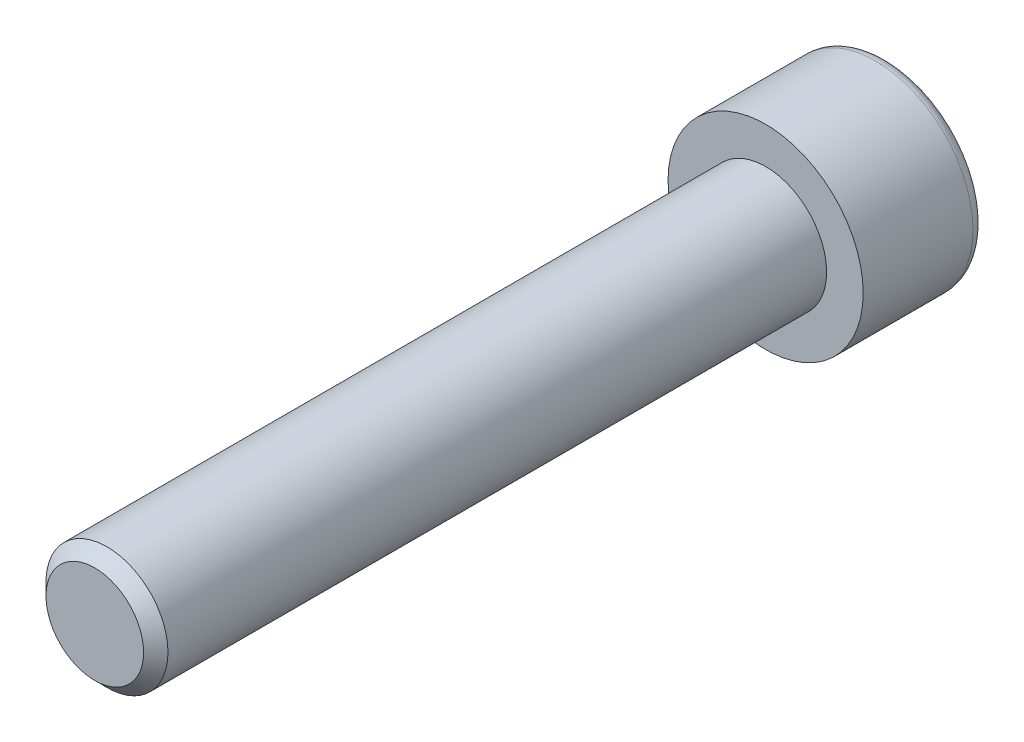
ISO-10303-21;
HEADER;
FILE_DESCRIPTION(('STEP AP214'),'2;1');
FILE_NAME('part.step','',(''),(''),'','','');
FILE_SCHEMA(('AUTOMOTIVE_DESIGN { 1 0 10303 214 1 1 1 1 }'));
ENDSEC;
DATA;
#1=APPLICATION_CONTEXT('core data for automotive mechanical design processes');
#2=APPLICATION_PROTOCOL_DEFINITION('international standard','automotive_design',2000,#1);
#3=PRODUCT_CONTEXT('',#1,'mechanical');
#4=PRODUCT('Part','Part','',(#3));
#5=PRODUCT_RELATED_PRODUCT_CATEGORY('part','',(#4));
#6=PRODUCT_DEFINITION_FORMATION('','',#4);
#7=PRODUCT_DEFINITION_CONTEXT('part definition',#1,'design');
#8=PRODUCT_DEFINITION('design','',#6,#7);
#9=PRODUCT_DEFINITION_SHAPE('','',#8);
#10=(LENGTH_UNIT() NAMED_UNIT(*) SI_UNIT(.MILLI.,.METRE.));
#11=(NAMED_UNIT(*) PLANE_ANGLE_UNIT() SI_UNIT($,.RADIAN.));
#12=(NAMED_UNIT(*) SI_UNIT($,.STERADIAN.) SOLID_ANGLE_UNIT());
#13=UNCERTAINTY_MEASURE_WITH_UNIT(LENGTH_MEASURE(1.E-05),#10,'distance_accuracy_value','');
#14=(GEOMETRIC_REPRESENTATION_CONTEXT(3) GLOBAL_UNCERTAINTY_ASSIGNED_CONTEXT((#13)) GLOBAL_UNIT_ASSIGNED_CONTEXT((#10,
#11,#12)) REPRESENTATION_CONTEXT('',''));
#15=CARTESIAN_POINT('',(0.,0.,0.));
#16=DIRECTION('',(0.,0.,1.));
#17=DIRECTION('',(1.,0.,0.));
#18=AXIS2_PLACEMENT_3D('',#15,#16,#17);
#19=CARTESIAN_POINT('',(0.,0.,-10.));
#20=DIRECTION('',(0.,0.,1.));
#21=DIRECTION('',(1.,0.,0.));
#22=AXIS2_PLACEMENT_3D('',#19,#20,#21);
#23=PLANE('',#22);
#24=CARTESIAN_POINT('',(0.,0.,-10.));
#25=DIRECTION('',(0.,0.,-1.));
#26=DIRECTION('',(-1.,0.,0.));
#27=AXIS2_PLACEMENT_3D('',#24,#25,#26);
#28=CIRCLE('',#27,7.);
#29=CARTESIAN_POINT('',(-7.,0.,-10.));
#30=VERTEX_POINT('',#29);
#31=EDGE_CURVE('E141',#30,#30,#28,.T.);
#32=ORIENTED_EDGE('',*,*,#31,.T.);
#33=EDGE_LOOP('',(#32));
#34=FACE_BOUND('',#33,.T.);
#35=DIRECTION('',(-0.86602540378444,0.499999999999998,0.));
#36=VECTOR('',#35,1.);
#37=CARTESIAN_POINT('',(-2.22044604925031E-13,4.61880215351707,-10.));
#38=LINE('',#37,#36);
#39=CARTESIAN_POINT('',(3.99999999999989,2.30940107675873,-10.));
#40=VERTEX_POINT('',#39);
#41=CARTESIAN_POINT('',(-2.22044604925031E-13,4.61880215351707,-10.));
#42=VERTEX_POINT('',#41);
#43=EDGE_CURVE('E45',#40,#42,#38,.T.);
#44=ORIENTED_EDGE('',*,*,#43,.T.);
#45=DIRECTION('',(-0.866025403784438,-0.500000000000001,0.));
#46=VECTOR('',#45,1.);
#47=CARTESIAN_POINT('',(-2.22044604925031E-13,4.61880215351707,-10.));
#48=LINE('',#47,#46);
#49=CARTESIAN_POINT('',(-4.00000000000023,2.30940107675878,-10.));
#50=VERTEX_POINT('',#49);
#51=EDGE_CURVE('E85',#42,#50,#48,.T.);
#52=ORIENTED_EDGE('',*,*,#51,.T.);
#53=DIRECTION('',(0.,-1.,0.));
#54=VECTOR('',#53,1.);
#55=CARTESIAN_POINT('',(-4.00000000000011,-2.30940107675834,-10.));
#56=LINE('',#55,#54);
#57=CARTESIAN_POINT('',(-4.00000000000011,-2.30940107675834,-10.));
#58=VERTEX_POINT('',#57);
#59=EDGE_CURVE('E93',#50,#58,#56,.T.);
#60=ORIENTED_EDGE('',*,*,#59,.T.);
#61=DIRECTION('',(0.866025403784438,-0.500000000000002,0.));
#62=VECTOR('',#61,1.);
#63=CARTESIAN_POINT('',(-1.66533453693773E-13,-4.61880215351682,-10.));
#64=LINE('',#63,#62);
#65=CARTESIAN_POINT('',(-1.66533453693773E-13,-4.61880215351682,-10.));
#66=VERTEX_POINT('',#65);
#67=EDGE_CURVE('E111',#58,#66,#64,.T.);
#68=ORIENTED_EDGE('',*,*,#67,.T.);
#69=DIRECTION('',(0.86602540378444,0.499999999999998,0.));
#70=VECTOR('',#69,1.);
#71=CARTESIAN_POINT('',(-1.66533453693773E-13,-4.61880215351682,-10.));
#72=LINE('',#71,#70);
#73=CARTESIAN_POINT('',(3.99999999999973,-2.30940107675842,-10.));
#74=VERTEX_POINT('',#73);
#75=EDGE_CURVE('E114',#66,#74,#72,.T.);
#76=ORIENTED_EDGE('',*,*,#75,.T.);
#77=DIRECTION('',(0.,1.,0.));
#78=VECTOR('',#77,1.);
#79=CARTESIAN_POINT('',(3.99999999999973,-2.30940107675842,-10.));
#80=LINE('',#79,#78);
#81=EDGE_CURVE('E104',#74,#40,#80,.T.);
#82=ORIENTED_EDGE('',*,*,#81,.T.);
#83=EDGE_LOOP('',(#44,#52,#60,#68,#76,#82));
#84=FACE_BOUND('',#83,.T.);
#85=ADVANCED_FACE('F31',(#34,#84),#23,.F.);
#86=CARTESIAN_POINT('',(0.,0.,-9.));
#87=DIRECTION('',(0.,0.,-1.));
#88=DIRECTION('',(-1.,0.,0.));
#89=AXIS2_PLACEMENT_3D('',#86,#87,#88);
#90=TOROIDAL_SURFACE('',#89,7.,0.999999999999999);
#91=ORIENTED_EDGE('',*,*,#31,.F.);
#92=EDGE_LOOP('',(#91));
#93=FACE_BOUND('',#92,.T.);
#94=CARTESIAN_POINT('',(0.,0.,-9.));
#95=DIRECTION('',(0.,0.,-1.));
#96=DIRECTION('',(-1.,0.,0.));
#97=AXIS2_PLACEMENT_3D('',#94,#95,#96);
#98=CIRCLE('',#97,8.);
#99=CARTESIAN_POINT('',(-8.,0.,-9.));
#100=VERTEX_POINT('',#99);
#101=EDGE_CURVE('E138',#100,#100,#98,.T.);
#102=ORIENTED_EDGE('',*,*,#101,.T.);
#103=EDGE_LOOP('',(#102));
#104=FACE_BOUND('',#103,.T.);
#105=ADVANCED_FACE('F160',(#93,#104),#90,.T.);
#106=CARTESIAN_POINT('',(0.,0.,0.));
#107=DIRECTION('',(0.,0.,-1.));
#108=DIRECTION('',(-1.,0.,0.));
#109=AXIS2_PLACEMENT_3D('',#106,#107,#108);
#110=CYLINDRICAL_SURFACE('',#109,8.);
#111=ORIENTED_EDGE('',*,*,#101,.F.);
#112=EDGE_LOOP('',(#111));
#113=FACE_BOUND('',#112,.T.);
#114=CARTESIAN_POINT('',(0.,0.,0.));
#115=DIRECTION('',(0.,0.,-1.));
#116=DIRECTION('',(-1.,0.,0.));
#117=AXIS2_PLACEMENT_3D('',#114,#115,#116);
#118=CIRCLE('',#117,8.);
#119=CARTESIAN_POINT('',(-8.,0.,0.));
#120=VERTEX_POINT('',#119);
#121=EDGE_CURVE('E99',#120,#120,#118,.T.);
#122=ORIENTED_EDGE('',*,*,#121,.T.);
#123=EDGE_LOOP('',(#122));
#124=FACE_BOUND('',#123,.T.);
#125=ADVANCED_FACE('F165',(#113,#124),#110,.T.);
#126=CARTESIAN_POINT('',(0.,0.,0.));
#127=DIRECTION('',(0.,0.,-1.));
#128=DIRECTION('',(-1.,0.,0.));
#129=AXIS2_PLACEMENT_3D('',#126,#127,#128);
#130=PLANE('',#129);
#131=CARTESIAN_POINT('',(0.,0.,0.));
#132=DIRECTION('',(0.,0.,1.));
#133=DIRECTION('',(1.,0.,0.));
#134=AXIS2_PLACEMENT_3D('',#131,#132,#133);
#135=CIRCLE('',#134,5.);
#136=CARTESIAN_POINT('',(5.,0.,0.));
#137=VERTEX_POINT('',#136);
#138=EDGE_CURVE('E105',#137,#137,#135,.T.);
#139=ORIENTED_EDGE('',*,*,#138,.F.);
#140=EDGE_LOOP('',(#139));
#141=FACE_BOUND('',#140,.T.);
#142=ORIENTED_EDGE('',*,*,#121,.F.);
#143=EDGE_LOOP('',(#142));
#144=FACE_BOUND('',#143,.T.);
#145=ADVANCED_FACE('F173',(#141,#144),#130,.F.);
#146=CARTESIAN_POINT('',(-2.22044604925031E-13,4.61880215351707,-5.));
#147=DIRECTION('',(-0.499999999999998,-0.86602540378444,0.));
#148=DIRECTION('',(0.86602540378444,-0.499999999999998,0.));
#149=AXIS2_PLACEMENT_3D('',#146,#147,#148);
#150=PLANE('',#149);
#151=ORIENTED_EDGE('',*,*,#43,.F.);
#152=DIRECTION('',(0.,0.,-1.));
#153=VECTOR('',#152,1.);
#154=CARTESIAN_POINT('',(3.99999999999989,2.30940107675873,-5.));
#155=LINE('',#154,#153);
#156=CARTESIAN_POINT('',(3.99999999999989,2.30940107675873,-5.));
#157=VERTEX_POINT('',#156);
#158=EDGE_CURVE('E127',#157,#40,#155,.T.);
#159=ORIENTED_EDGE('',*,*,#158,.F.);
#160=DIRECTION('',(-0.86602540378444,0.499999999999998,0.));
#161=VECTOR('',#160,1.);
#162=CARTESIAN_POINT('',(-2.22044604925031E-13,4.61880215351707,-5.));
#163=LINE('',#162,#161);
#164=CARTESIAN_POINT('',(-2.22044604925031E-13,4.61880215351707,-5.));
#165=VERTEX_POINT('',#164);
#166=EDGE_CURVE('E98',#157,#165,#163,.T.);
#167=ORIENTED_EDGE('',*,*,#166,.T.);
#168=DIRECTION('',(0.,0.,-1.));
#169=VECTOR('',#168,1.);
#170=CARTESIAN_POINT('',(-2.22044604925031E-13,4.61880215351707,-5.));
#171=LINE('',#170,#169);
#172=EDGE_CURVE('E87',#165,#42,#171,.T.);
#173=ORIENTED_EDGE('',*,*,#172,.T.);
#174=EDGE_LOOP('',(#151,#159,#167,#173));
#175=FACE_BOUND('',#174,.T.);
#176=ADVANCED_FACE('F96',(#175),#150,.T.);
#177=CARTESIAN_POINT('',(-2.22044604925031E-13,4.61880215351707,-5.));
#178=DIRECTION('',(0.500000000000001,-0.866025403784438,0.));
#179=DIRECTION('',(0.866025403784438,0.500000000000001,0.));
#180=AXIS2_PLACEMENT_3D('',#177,#178,#179);
#181=PLANE('',#180);
#182=ORIENTED_EDGE('',*,*,#51,.F.);
#183=ORIENTED_EDGE('',*,*,#172,.F.);
#184=DIRECTION('',(-0.866025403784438,-0.500000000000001,0.));
#185=VECTOR('',#184,1.);
#186=CARTESIAN_POINT('',(-2.22044604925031E-13,4.61880215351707,-5.));
#187=LINE('',#186,#185);
#188=CARTESIAN_POINT('',(-4.00000000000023,2.30940107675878,-5.));
#189=VERTEX_POINT('',#188);
#190=EDGE_CURVE('E118',#165,#189,#187,.T.);
#191=ORIENTED_EDGE('',*,*,#190,.T.);
#192=DIRECTION('',(0.,0.,-1.));
#193=VECTOR('',#192,1.);
#194=CARTESIAN_POINT('',(-4.00000000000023,2.30940107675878,-5.));
#195=LINE('',#194,#193);
#196=EDGE_CURVE('E89',#189,#50,#195,.T.);
#197=ORIENTED_EDGE('',*,*,#196,.T.);
#198=EDGE_LOOP('',(#182,#183,#191,#197));
#199=FACE_BOUND('',#198,.T.);
#200=ADVANCED_FACE('F86',(#199),#181,.T.);
#201=CARTESIAN_POINT('',(-4.00000000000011,-2.30940107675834,-5.));
#202=DIRECTION('',(1.,0.,0.));
#203=DIRECTION('',(0.,0.,-1.));
#204=AXIS2_PLACEMENT_3D('',#201,#202,#203);
#205=PLANE('',#204);
#206=ORIENTED_EDGE('',*,*,#59,.F.);
#207=ORIENTED_EDGE('',*,*,#196,.F.);
#208=DIRECTION('',(0.,-1.,0.));
#209=VECTOR('',#208,1.);
#210=CARTESIAN_POINT('',(-4.00000000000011,-2.30940107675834,-5.));
#211=LINE('',#210,#209);
#212=CARTESIAN_POINT('',(-4.00000000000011,-2.30940107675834,-5.));
#213=VERTEX_POINT('',#212);
#214=EDGE_CURVE('E120',#189,#213,#211,.T.);
#215=ORIENTED_EDGE('',*,*,#214,.T.);
#216=DIRECTION('',(0.,0.,-1.));
#217=VECTOR('',#216,1.);
#218=CARTESIAN_POINT('',(-4.00000000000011,-2.30940107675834,-5.));
#219=LINE('',#218,#217);
#220=EDGE_CURVE('E133',#213,#58,#219,.T.);
#221=ORIENTED_EDGE('',*,*,#220,.T.);
#222=EDGE_LOOP('',(#206,#207,#215,#221));
#223=FACE_BOUND('',#222,.T.);
#224=ADVANCED_FACE('F188',(#223),#205,.T.);
#225=CARTESIAN_POINT('',(-1.66533453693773E-13,-4.61880215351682,-5.));
#226=DIRECTION('',(0.500000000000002,0.866025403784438,0.));
#227=DIRECTION('',(-0.866025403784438,0.500000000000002,0.));
#228=AXIS2_PLACEMENT_3D('',#225,#226,#227);
#229=PLANE('',#228);
#230=ORIENTED_EDGE('',*,*,#67,.F.);
#231=ORIENTED_EDGE('',*,*,#220,.F.);
#232=DIRECTION('',(0.866025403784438,-0.500000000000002,0.));
#233=VECTOR('',#232,1.);
#234=CARTESIAN_POINT('',(-1.66533453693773E-13,-4.61880215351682,-5.));
#235=LINE('',#234,#233);
#236=CARTESIAN_POINT('',(-1.66533453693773E-13,-4.61880215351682,-5.));
#237=VERTEX_POINT('',#236);
#238=EDGE_CURVE('E122',#213,#237,#235,.T.);
#239=ORIENTED_EDGE('',*,*,#238,.T.);
#240=DIRECTION('',(0.,0.,-1.));
#241=VECTOR('',#240,1.);
#242=CARTESIAN_POINT('',(-1.66533453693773E-13,-4.61880215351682,-5.));
#243=LINE('',#242,#241);
#244=EDGE_CURVE('E131',#237,#66,#243,.T.);
#245=ORIENTED_EDGE('',*,*,#244,.T.);
#246=EDGE_LOOP('',(#230,#231,#239,#245));
#247=FACE_BOUND('',#246,.T.);
#248=ADVANCED_FACE('F191',(#247),#229,.T.);
#249=CARTESIAN_POINT('',(-1.66533453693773E-13,-4.61880215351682,-5.));
#250=DIRECTION('',(-0.499999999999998,0.86602540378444,0.));
#251=DIRECTION('',(-0.86602540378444,-0.499999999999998,0.));
#252=AXIS2_PLACEMENT_3D('',#249,#250,#251);
#253=PLANE('',#252);
#254=ORIENTED_EDGE('',*,*,#75,.F.);
#255=ORIENTED_EDGE('',*,*,#244,.F.);
#256=DIRECTION('',(0.86602540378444,0.499999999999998,0.));
#257=VECTOR('',#256,1.);
#258=CARTESIAN_POINT('',(-1.66533453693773E-13,-4.61880215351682,-5.));
#259=LINE('',#258,#257);
#260=CARTESIAN_POINT('',(3.99999999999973,-2.30940107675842,-5.));
#261=VERTEX_POINT('',#260);
#262=EDGE_CURVE('E124',#237,#261,#259,.T.);
#263=ORIENTED_EDGE('',*,*,#262,.T.);
#264=DIRECTION('',(0.,0.,-1.));
#265=VECTOR('',#264,1.);
#266=CARTESIAN_POINT('',(3.99999999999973,-2.30940107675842,-5.));
#267=LINE('',#266,#265);
#268=EDGE_CURVE('E129',#261,#74,#267,.T.);
#269=ORIENTED_EDGE('',*,*,#268,.T.);
#270=EDGE_LOOP('',(#254,#255,#263,#269));
#271=FACE_BOUND('',#270,.T.);
#272=ADVANCED_FACE('F195',(#271),#253,.T.);
#273=CARTESIAN_POINT('',(3.99999999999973,-2.30940107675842,-5.));
#274=DIRECTION('',(-1.,0.,0.));
#275=DIRECTION('',(0.,-1.,0.));
#276=AXIS2_PLACEMENT_3D('',#273,#274,#275);
#277=PLANE('',#276);
#278=ORIENTED_EDGE('',*,*,#81,.F.);
#279=ORIENTED_EDGE('',*,*,#268,.F.);
#280=DIRECTION('',(0.,1.,0.));
#281=VECTOR('',#280,1.);
#282=CARTESIAN_POINT('',(3.99999999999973,-2.30940107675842,-5.));
#283=LINE('',#282,#281);
#284=EDGE_CURVE('E52',#261,#157,#283,.T.);
#285=ORIENTED_EDGE('',*,*,#284,.T.);
#286=ORIENTED_EDGE('',*,*,#158,.T.);
#287=EDGE_LOOP('',(#278,#279,#285,#286));
#288=FACE_BOUND('',#287,.T.);
#289=ADVANCED_FACE('F199',(#288),#277,.T.);
#290=CARTESIAN_POINT('',(3.99999999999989,2.30940107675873,-5.));
#291=DIRECTION('',(0.,0.,1.));
#292=DIRECTION('',(1.,0.,0.));
#293=AXIS2_PLACEMENT_3D('',#290,#291,#292);
#294=PLANE('',#293);
#295=ORIENTED_EDGE('',*,*,#166,.F.);
#296=ORIENTED_EDGE('',*,*,#284,.F.);
#297=ORIENTED_EDGE('',*,*,#262,.F.);
#298=ORIENTED_EDGE('',*,*,#238,.F.);
#299=ORIENTED_EDGE('',*,*,#214,.F.);
#300=ORIENTED_EDGE('',*,*,#190,.F.);
#301=EDGE_LOOP('',(#295,#296,#297,#298,#299,#300));
#302=FACE_BOUND('',#301,.T.);
#303=ADVANCED_FACE('F203',(#302),#294,.F.);
#304=CARTESIAN_POINT('',(0.,0.,55.));
#305=DIRECTION('',(0.,0.,1.));
#306=DIRECTION('',(1.,0.,0.));
#307=AXIS2_PLACEMENT_3D('',#304,#305,#306);
#308=PLANE('',#307);
#309=CARTESIAN_POINT('',(0.,0.,55.));
#310=DIRECTION('',(0.,0.,1.));
#311=DIRECTION('',(1.,0.,0.));
#312=AXIS2_PLACEMENT_3D('',#309,#310,#311);
#313=CIRCLE('',#312,4.);
#314=CARTESIAN_POINT('',(4.,0.,55.));
#315=VERTEX_POINT('',#314);
#316=EDGE_CURVE('E38',#315,#315,#313,.T.);
#317=ORIENTED_EDGE('',*,*,#316,.T.);
#318=EDGE_LOOP('',(#317));
#319=FACE_BOUND('',#318,.T.);
#320=ADVANCED_FACE('F146',(#319),#308,.T.);
#321=CARTESIAN_POINT('',(0.,0.,0.));
#322=DIRECTION('',(0.,0.,1.));
#323=DIRECTION('',(1.,0.,0.));
#324=AXIS2_PLACEMENT_3D('',#321,#322,#323);
#325=CYLINDRICAL_SURFACE('',#324,5.);
#326=CARTESIAN_POINT('',(0.,0.,54.));
#327=DIRECTION('',(0.,0.,1.));
#328=DIRECTION('',(1.,0.,0.));
#329=AXIS2_PLACEMENT_3D('',#326,#327,#328);
#330=CIRCLE('',#329,5.);
#331=CARTESIAN_POINT('',(5.,0.,54.));
#332=VERTEX_POINT('',#331);
#333=EDGE_CURVE('E11',#332,#332,#330,.F.);
#334=ORIENTED_EDGE('',*,*,#333,.T.);
#335=EDGE_LOOP('',(#334));
#336=FACE_BOUND('',#335,.T.);
#337=ORIENTED_EDGE('',*,*,#138,.T.);
#338=EDGE_LOOP('',(#337));
#339=FACE_BOUND('',#338,.T.);
#340=ADVANCED_FACE('F150',(#336,#339),#325,.T.);
#341=CARTESIAN_POINT('',(0.,0.,55.));
#342=DIRECTION('',(0.,0.,-1.));
#343=DIRECTION('',(-1.,0.,0.));
#344=AXIS2_PLACEMENT_3D('',#341,#342,#343);
#345=CONICAL_SURFACE('',#344,4.,0.785398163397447);
#346=ORIENTED_EDGE('',*,*,#333,.F.);
#347=EDGE_LOOP('',(#346));
#348=FACE_BOUND('',#347,.T.);
#349=ORIENTED_EDGE('',*,*,#316,.F.);
#350=EDGE_LOOP('',(#349));
#351=FACE_BOUND('',#350,.T.);
#352=ADVANCED_FACE('F148',(#348,#351),#345,.T.);
#353=CLOSED_SHELL('',(#85,#105,#125,#145,#176,#200,#224,#248,#272,#289,#303,#320,#340,#352));
#354=MANIFOLD_SOLID_BREP('B2',#353);
#355=ADVANCED_BREP_SHAPE_REPRESENTATION('',(#18,#354),#14);
#356=SHAPE_DEFINITION_REPRESENTATION(#9,#355);
ENDSEC;
END-ISO-10303-21;
